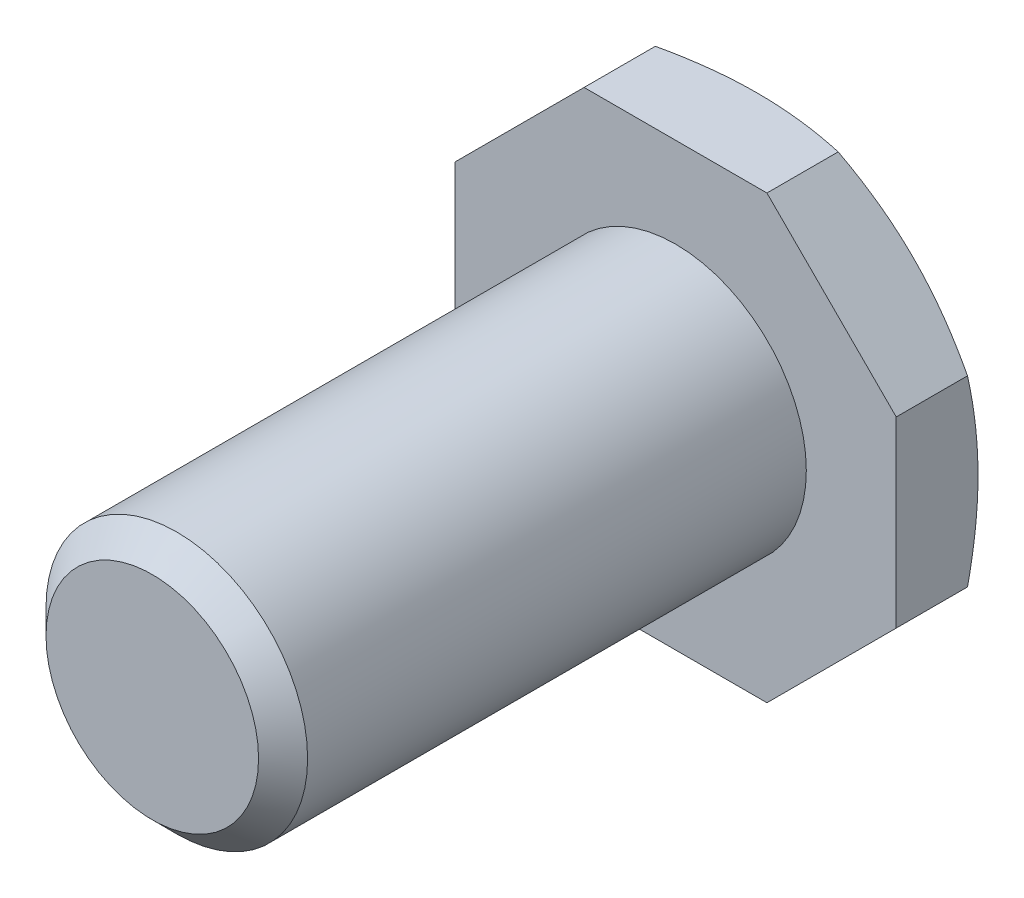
ISO-10303-21;
HEADER;
FILE_DESCRIPTION(('STEP AP214'),'2;1');
FILE_NAME('part.step','',(''),(''),'','','');
FILE_SCHEMA(('AUTOMOTIVE_DESIGN { 1 0 10303 214 1 1 1 1 }'));
ENDSEC;
DATA;
#1=APPLICATION_CONTEXT('core data for automotive mechanical design processes');
#2=APPLICATION_PROTOCOL_DEFINITION('international standard','automotive_design',2000,#1);
#3=PRODUCT_CONTEXT('',#1,'mechanical');
#4=PRODUCT('Part','Part','',(#3));
#5=PRODUCT_RELATED_PRODUCT_CATEGORY('part','',(#4));
#6=PRODUCT_DEFINITION_FORMATION('','',#4);
#7=PRODUCT_DEFINITION_CONTEXT('part definition',#1,'design');
#8=PRODUCT_DEFINITION('design','',#6,#7);
#9=PRODUCT_DEFINITION_SHAPE('','',#8);
#10=(LENGTH_UNIT() NAMED_UNIT(*) SI_UNIT(.MILLI.,.METRE.));
#11=(NAMED_UNIT(*) PLANE_ANGLE_UNIT() SI_UNIT($,.RADIAN.));
#12=(NAMED_UNIT(*) SI_UNIT($,.STERADIAN.) SOLID_ANGLE_UNIT());
#13=UNCERTAINTY_MEASURE_WITH_UNIT(LENGTH_MEASURE(1.E-05),#10,'distance_accuracy_value','');
#14=(GEOMETRIC_REPRESENTATION_CONTEXT(3) GLOBAL_UNCERTAINTY_ASSIGNED_CONTEXT((#13)) GLOBAL_UNIT_ASSIGNED_CONTEXT((#10,
#11,#12)) REPRESENTATION_CONTEXT('',''));
#15=CARTESIAN_POINT('',(0.,0.,0.));
#16=DIRECTION('',(0.,0.,1.));
#17=DIRECTION('',(1.,0.,0.));
#18=AXIS2_PLACEMENT_3D('',#15,#16,#17);
#19=CARTESIAN_POINT('',(0.,0.,22.8865));
#20=DIRECTION('',(0.,0.,1.));
#21=DIRECTION('',(0.,1.,0.));
#22=AXIS2_PLACEMENT_3D('',#19,#20,#21);
#23=CYLINDRICAL_SURFACE('',#22,8.);
#24=CARTESIAN_POINT('',(0.,0.,35.5));
#25=DIRECTION('',(0.,0.,1.));
#26=DIRECTION('',(1.,0.,0.));
#27=AXIS2_PLACEMENT_3D('',#24,#25,#26);
#28=CIRCLE('',#27,8.);
#29=CARTESIAN_POINT('',(8.,0.,35.5));
#30=VERTEX_POINT('',#29);
#31=EDGE_CURVE('E9',#30,#30,#28,.F.);
#32=ORIENTED_EDGE('',*,*,#31,.T.);
#33=EDGE_LOOP('',(#32));
#34=FACE_BOUND('',#33,.T.);
#35=CARTESIAN_POINT('',(0.,0.,5.));
#36=DIRECTION('',(0.,0.,1.));
#37=DIRECTION('',(0.,1.,0.));
#38=AXIS2_PLACEMENT_3D('',#35,#36,#37);
#39=CIRCLE('',#38,8.);
#40=CARTESIAN_POINT('',(0.,8.,5.));
#41=VERTEX_POINT('',#40);
#42=EDGE_CURVE('E201',#41,#41,#39,.T.);
#43=ORIENTED_EDGE('',*,*,#42,.T.);
#44=EDGE_LOOP('',(#43));
#45=FACE_BOUND('',#44,.T.);
#46=ADVANCED_FACE('F14',(#34,#45),#23,.T.);
#47=CARTESIAN_POINT('',(0.,-6.75,0.));
#48=DIRECTION('',(0.,0.,-1.));
#49=DIRECTION('',(0.,-1.,0.));
#50=AXIS2_PLACEMENT_3D('',#47,#48,#49);
#51=PLANE('',#50);
#52=CARTESIAN_POINT('',(0.,0.,0.));
#53=DIRECTION('',(0.,0.,1.));
#54=DIRECTION('',(0.,1.,0.));
#55=AXIS2_PLACEMENT_3D('',#52,#53,#54);
#56=CIRCLE('',#55,13.5);
#57=CARTESIAN_POINT('',(9.54594154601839,-9.54594154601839,0.));
#58=VERTEX_POINT('',#57);
#59=CARTESIAN_POINT('',(13.5,0.,0.));
#60=VERTEX_POINT('',#59);
#61=EDGE_CURVE('E101',#58,#60,#56,.T.);
#62=ORIENTED_EDGE('',*,*,#61,.F.);
#63=CARTESIAN_POINT('',(0.,0.,0.));
#64=DIRECTION('',(0.,0.,1.));
#65=DIRECTION('',(0.,1.,0.));
#66=AXIS2_PLACEMENT_3D('',#63,#64,#65);
#67=CIRCLE('',#66,13.5);
#68=CARTESIAN_POINT('',(0.,-13.5,0.));
#69=VERTEX_POINT('',#68);
#70=EDGE_CURVE('E98',#69,#58,#67,.T.);
#71=ORIENTED_EDGE('',*,*,#70,.F.);
#72=CARTESIAN_POINT('',(0.,0.,0.));
#73=DIRECTION('',(0.,0.,1.));
#74=DIRECTION('',(0.,1.,0.));
#75=AXIS2_PLACEMENT_3D('',#72,#73,#74);
#76=CIRCLE('',#75,13.5);
#77=CARTESIAN_POINT('',(-9.54594154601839,-9.54594154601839,0.));
#78=VERTEX_POINT('',#77);
#79=EDGE_CURVE('E404',#78,#69,#76,.T.);
#80=ORIENTED_EDGE('',*,*,#79,.F.);
#81=CARTESIAN_POINT('',(0.,0.,0.));
#82=DIRECTION('',(0.,0.,1.));
#83=DIRECTION('',(0.,1.,0.));
#84=AXIS2_PLACEMENT_3D('',#81,#82,#83);
#85=CIRCLE('',#84,13.5);
#86=CARTESIAN_POINT('',(-13.5,0.,0.));
#87=VERTEX_POINT('',#86);
#88=EDGE_CURVE('E164',#87,#78,#85,.T.);
#89=ORIENTED_EDGE('',*,*,#88,.F.);
#90=CARTESIAN_POINT('',(0.,0.,0.));
#91=DIRECTION('',(0.,0.,1.));
#92=DIRECTION('',(0.,1.,0.));
#93=AXIS2_PLACEMENT_3D('',#90,#91,#92);
#94=CIRCLE('',#93,13.5);
#95=CARTESIAN_POINT('',(-9.54594154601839,9.54594154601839,0.));
#96=VERTEX_POINT('',#95);
#97=EDGE_CURVE('E424',#96,#87,#94,.T.);
#98=ORIENTED_EDGE('',*,*,#97,.F.);
#99=CARTESIAN_POINT('',(0.,0.,0.));
#100=DIRECTION('',(0.,0.,1.));
#101=DIRECTION('',(0.,1.,0.));
#102=AXIS2_PLACEMENT_3D('',#99,#100,#101);
#103=CIRCLE('',#102,13.5);
#104=CARTESIAN_POINT('',(0.,13.5,0.));
#105=VERTEX_POINT('',#104);
#106=EDGE_CURVE('E425',#105,#96,#103,.T.);
#107=ORIENTED_EDGE('',*,*,#106,.F.);
#108=CARTESIAN_POINT('',(0.,0.,0.));
#109=DIRECTION('',(0.,0.,1.));
#110=DIRECTION('',(0.,1.,0.));
#111=AXIS2_PLACEMENT_3D('',#108,#109,#110);
#112=CIRCLE('',#111,13.5);
#113=CARTESIAN_POINT('',(9.54594154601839,9.54594154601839,0.));
#114=VERTEX_POINT('',#113);
#115=EDGE_CURVE('E427',#114,#105,#112,.T.);
#116=ORIENTED_EDGE('',*,*,#115,.F.);
#117=CARTESIAN_POINT('',(0.,0.,0.));
#118=DIRECTION('',(0.,0.,1.));
#119=DIRECTION('',(0.,1.,0.));
#120=AXIS2_PLACEMENT_3D('',#117,#118,#119);
#121=CIRCLE('',#120,13.5);
#122=EDGE_CURVE('E104',#60,#114,#121,.T.);
#123=ORIENTED_EDGE('',*,*,#122,.F.);
#124=EDGE_LOOP('',(#62,#71,#80,#89,#98,#107,#116,#123));
#125=FACE_BOUND('',#124,.T.);
#126=ADVANCED_FACE('F102',(#125),#51,.T.);
#127=CARTESIAN_POINT('',(0.,0.,0.646036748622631));
#128=DIRECTION('',(0.,0.,1.));
#129=DIRECTION('',(0.,1.,0.));
#130=AXIS2_PLACEMENT_3D('',#127,#128,#129);
#131=CONICAL_SURFACE('',#130,14.618968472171,1.0471975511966);
#132=CARTESIAN_POINT('',(5.59188309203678,-13.5,0.642183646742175));
#133=CARTESIAN_POINT('',(5.36212723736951,-13.5,0.591421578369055));
#134=CARTESIAN_POINT('',(5.13181713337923,-13.5,0.543207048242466));
#135=CARTESIAN_POINT('',(4.67009972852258,-13.5,0.452239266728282));
#136=CARTESIAN_POINT('',(4.43869232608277,-13.5,0.409486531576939));
#137=CARTESIAN_POINT('',(3.74435537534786,-13.5,0.290233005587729));
#138=CARTESIAN_POINT('',(3.27987510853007,-13.5,0.222415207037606));
#139=CARTESIAN_POINT('',(2.58083893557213,-13.5,0.140054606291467));
#140=CARTESIAN_POINT('',(2.34738626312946,-13.5,0.115825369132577));
#141=CARTESIAN_POINT('',(1.87987316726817,-13.5,0.0740751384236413));
#142=CARTESIAN_POINT('',(1.64581274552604,-13.5,0.0565541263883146));
#143=CARTESIAN_POINT('',(1.17657417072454,-13.5,0.028382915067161));
#144=CARTESIAN_POINT('',(0.941394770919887,-13.5,0.0177534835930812));
#145=CARTESIAN_POINT('',(0.470811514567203,-13.5,0.00355463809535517));
#146=CARTESIAN_POINT('',(0.23540764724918,-13.5,-1.44181495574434E-05));
#147=CARTESIAN_POINT('',(0.,-13.5,0.));
#148=B_SPLINE_CURVE_WITH_KNOTS('',3,(#132,#133,#134,#135,#136,#137,#138,#139,#140,#141,#142,
#143,#144,#145,#146,#147),.UNSPECIFIED.,.F.,.F.,(4,2,2,2,2,2,2,4),(0.,0.705854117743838,
1.41177490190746,2.8192062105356,3.52324995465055,4.22729175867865,4.93344545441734,
5.63963493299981),.UNSPECIFIED.);
#149=CARTESIAN_POINT('',(5.59188309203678,-13.5,0.642183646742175));
#150=VERTEX_POINT('',#149);
#151=EDGE_CURVE('E114',#150,#69,#148,.T.);
#152=ORIENTED_EDGE('',*,*,#151,.T.);
#153=ORIENTED_EDGE('',*,*,#70,.T.);
#154=CARTESIAN_POINT('',(9.54594154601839,-9.54594154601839,0.));
#155=CARTESIAN_POINT('',(9.37948320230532,-9.71239988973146,-1.44181495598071E-05));
#156=CARTESIAN_POINT('',(9.2130275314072,-9.87885556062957,0.00355463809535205));
#157=CARTESIAN_POINT('',(8.88027491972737,-10.2116081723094,0.0177534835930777));
#158=CARTESIAN_POINT('',(8.71397797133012,-10.3779051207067,0.0283829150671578));
#159=CARTESIAN_POINT('',(8.38217619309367,-10.7097068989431,0.056554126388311));
#160=CARTESIAN_POINT('',(8.21667048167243,-10.8752126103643,0.0740751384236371));
#161=CARTESIAN_POINT('',(7.88608880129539,-11.2057942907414,0.115825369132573));
#162=CARTESIAN_POINT('',(7.72101283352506,-11.3708702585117,0.140054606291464));
#163=CARTESIAN_POINT('',(7.22671961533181,-11.865163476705,0.222415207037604));
#164=CARTESIAN_POINT('',(6.89828246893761,-12.1936006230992,0.290233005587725));
#165=CARTESIAN_POINT('',(6.40731210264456,-12.6845709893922,0.409486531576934));
#166=CARTESIAN_POINT('',(6.2436823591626,-12.8482007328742,0.452239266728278));
#167=CARTESIAN_POINT('',(5.91719885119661,-13.1746842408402,0.543207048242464));
#168=CARTESIAN_POINT('',(5.75434501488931,-13.3375380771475,0.591421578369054));
#169=CARTESIAN_POINT('',(5.59188309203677,-13.5,0.642183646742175));
#170=B_SPLINE_CURVE_WITH_KNOTS('',3,(#154,#155,#156,#157,#158,#159,#160,#161,#162,#163,#164,
#165,#166,#167,#168,#169),.UNSPECIFIED.,.F.,.F.,(4,2,2,2,2,2,2,4),(0.,0.706189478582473,
1.41234317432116,2.11638497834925,2.8204287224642,4.22786003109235,4.93378081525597,
5.63963493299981),.UNSPECIFIED.);
#171=EDGE_CURVE('E112',#58,#150,#170,.T.);
#172=ORIENTED_EDGE('',*,*,#171,.T.);
#173=EDGE_LOOP('',(#152,#153,#172));
#174=FACE_BOUND('',#173,.T.);
#175=ADVANCED_FACE('F110',(#174),#131,.T.);
#176=CARTESIAN_POINT('',(0.,0.,0.646036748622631));
#177=DIRECTION('',(0.,0.,1.));
#178=DIRECTION('',(0.,1.,0.));
#179=AXIS2_PLACEMENT_3D('',#176,#177,#178);
#180=CONICAL_SURFACE('',#179,14.618968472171,1.0471975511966);
#181=CARTESIAN_POINT('',(13.5,-5.59188309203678,0.642183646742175));
#182=CARTESIAN_POINT('',(13.3375380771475,-5.75434501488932,0.591421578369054));
#183=CARTESIAN_POINT('',(13.1746842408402,-5.91719885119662,0.543207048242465));
#184=CARTESIAN_POINT('',(12.8482007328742,-6.24368235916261,0.452239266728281));
#185=CARTESIAN_POINT('',(12.6845709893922,-6.40731210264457,0.409486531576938));
#186=CARTESIAN_POINT('',(12.1936006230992,-6.89828246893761,0.290233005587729));
#187=CARTESIAN_POINT('',(11.865163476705,-7.22671961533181,0.222415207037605));
#188=CARTESIAN_POINT('',(11.3708702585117,-7.72101283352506,0.140054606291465));
#189=CARTESIAN_POINT('',(11.2057942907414,-7.88608880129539,0.115825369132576));
#190=CARTESIAN_POINT('',(10.8752126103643,-8.21667048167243,0.0740751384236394));
#191=CARTESIAN_POINT('',(10.7097068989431,-8.38217619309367,0.0565541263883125));
#192=CARTESIAN_POINT('',(10.3779051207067,-8.71397797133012,0.0283829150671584));
#193=CARTESIAN_POINT('',(10.2116081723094,-8.88027491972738,0.0177534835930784));
#194=CARTESIAN_POINT('',(9.87885556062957,-9.2130275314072,0.00355463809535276));
#195=CARTESIAN_POINT('',(9.71239988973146,-9.37948320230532,-1.44181495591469E-05));
#196=CARTESIAN_POINT('',(9.54594154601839,-9.54594154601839,0.));
#197=B_SPLINE_CURVE_WITH_KNOTS('',3,(#181,#182,#183,#184,#185,#186,#187,#188,#189,#190,#191,
#192,#193,#194,#195,#196),.UNSPECIFIED.,.F.,.F.,(4,2,2,2,2,2,2,4),(0.,0.705854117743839,
1.41177490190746,2.8192062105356,3.52324995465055,4.22729175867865,4.93344545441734,
5.63963493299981),.UNSPECIFIED.);
#198=CARTESIAN_POINT('',(13.5,-5.59188309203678,0.642183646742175));
#199=VERTEX_POINT('',#198);
#200=EDGE_CURVE('E118',#199,#58,#197,.T.);
#201=ORIENTED_EDGE('',*,*,#200,.T.);
#202=ORIENTED_EDGE('',*,*,#61,.T.);
#203=CARTESIAN_POINT('',(13.5,0.,0.));
#204=CARTESIAN_POINT('',(13.5,-0.235407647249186,-1.44181495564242E-05));
#205=CARTESIAN_POINT('',(13.5,-0.470811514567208,0.00355463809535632));
#206=CARTESIAN_POINT('',(13.5,-0.941394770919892,0.017753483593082));
#207=CARTESIAN_POINT('',(13.5,-1.17657417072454,0.0283829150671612));
#208=CARTESIAN_POINT('',(13.5,-1.64581274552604,0.0565541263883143));
#209=CARTESIAN_POINT('',(13.5,-1.87987316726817,0.074075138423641));
#210=CARTESIAN_POINT('',(13.5,-2.34738626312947,0.115825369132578));
#211=CARTESIAN_POINT('',(13.5,-2.58083893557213,0.140054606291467));
#212=CARTESIAN_POINT('',(13.5,-3.27987510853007,0.222415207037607));
#213=CARTESIAN_POINT('',(13.5,-3.74435537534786,0.290233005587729));
#214=CARTESIAN_POINT('',(13.5,-4.43869232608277,0.409486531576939));
#215=CARTESIAN_POINT('',(13.5,-4.67009972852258,0.452239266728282));
#216=CARTESIAN_POINT('',(13.5,-5.13181713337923,0.543207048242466));
#217=CARTESIAN_POINT('',(13.5,-5.36212723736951,0.591421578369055));
#218=CARTESIAN_POINT('',(13.5,-5.59188309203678,0.642183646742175));
#219=B_SPLINE_CURVE_WITH_KNOTS('',3,(#203,#204,#205,#206,#207,#208,#209,#210,#211,#212,#213,
#214,#215,#216,#217,#218),.UNSPECIFIED.,.F.,.F.,(4,2,2,2,2,2,2,4),(0.,0.70618947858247,
1.41234317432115,2.11638497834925,2.8204287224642,4.22786003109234,4.93378081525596,
5.6396349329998),.UNSPECIFIED.);
#220=EDGE_CURVE('E121',#60,#199,#219,.T.);
#221=ORIENTED_EDGE('',*,*,#220,.T.);
#222=EDGE_LOOP('',(#201,#202,#221));
#223=FACE_BOUND('',#222,.T.);
#224=ADVANCED_FACE('F119',(#223),#180,.T.);
#225=CARTESIAN_POINT('',(0.,0.,0.646036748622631));
#226=DIRECTION('',(0.,0.,1.));
#227=DIRECTION('',(0.,1.,0.));
#228=AXIS2_PLACEMENT_3D('',#225,#226,#227);
#229=CONICAL_SURFACE('',#228,14.618968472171,1.0471975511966);
#230=CARTESIAN_POINT('',(13.5,5.59188309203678,0.642183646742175));
#231=CARTESIAN_POINT('',(13.5,5.36212723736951,0.591421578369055));
#232=CARTESIAN_POINT('',(13.5,5.13181713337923,0.543207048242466));
#233=CARTESIAN_POINT('',(13.5,4.67009972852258,0.452239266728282));
#234=CARTESIAN_POINT('',(13.5,4.43869232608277,0.409486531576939));
#235=CARTESIAN_POINT('',(13.5,3.74435537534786,0.290233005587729));
#236=CARTESIAN_POINT('',(13.5,3.27987510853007,0.222415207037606));
#237=CARTESIAN_POINT('',(13.5,2.58083893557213,0.140054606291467));
#238=CARTESIAN_POINT('',(13.5,2.34738626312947,0.115825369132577));
#239=CARTESIAN_POINT('',(13.5,1.87987316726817,0.0740751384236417));
#240=CARTESIAN_POINT('',(13.5,1.64581274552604,0.0565541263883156));
#241=CARTESIAN_POINT('',(13.5,1.17657417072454,0.028382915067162));
#242=CARTESIAN_POINT('',(13.5,0.941394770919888,0.0177534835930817));
#243=CARTESIAN_POINT('',(13.5,0.470811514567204,0.00355463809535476));
#244=CARTESIAN_POINT('',(13.5,0.235407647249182,-1.44181495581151E-05));
#245=CARTESIAN_POINT('',(13.5,0.,0.));
#246=B_SPLINE_CURVE_WITH_KNOTS('',3,(#230,#231,#232,#233,#234,#235,#236,#237,#238,#239,#240,
#241,#242,#243,#244,#245),.UNSPECIFIED.,.F.,.F.,(4,2,2,2,2,2,2,4),(0.,0.705854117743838,
1.41177490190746,2.8192062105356,3.52324995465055,4.22729175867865,4.93344545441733,
5.6396349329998),.UNSPECIFIED.);
#247=CARTESIAN_POINT('',(13.5,5.59188309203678,0.642183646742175));
#248=VERTEX_POINT('',#247);
#249=EDGE_CURVE('E292',#248,#60,#246,.T.);
#250=ORIENTED_EDGE('',*,*,#249,.T.);
#251=ORIENTED_EDGE('',*,*,#122,.T.);
#252=CARTESIAN_POINT('',(9.54594154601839,9.54594154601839,0.));
#253=CARTESIAN_POINT('',(9.71239988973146,9.37948320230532,-1.44181495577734E-05));
#254=CARTESIAN_POINT('',(9.87885556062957,9.21302753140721,0.00355463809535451));
#255=CARTESIAN_POINT('',(10.2116081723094,8.88027491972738,0.0177534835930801));
#256=CARTESIAN_POINT('',(10.3779051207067,8.71397797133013,0.0283829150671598));
#257=CARTESIAN_POINT('',(10.7097068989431,8.38217619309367,0.0565541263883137));
#258=CARTESIAN_POINT('',(10.8752126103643,8.21667048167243,0.0740751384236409));
#259=CARTESIAN_POINT('',(11.2057942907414,7.88608880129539,0.115825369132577));
#260=CARTESIAN_POINT('',(11.3708702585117,7.72101283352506,0.140054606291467));
#261=CARTESIAN_POINT('',(11.865163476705,7.22671961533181,0.222415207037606));
#262=CARTESIAN_POINT('',(12.1936006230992,6.89828246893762,0.290233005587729));
#263=CARTESIAN_POINT('',(12.6845709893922,6.40731210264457,0.409486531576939));
#264=CARTESIAN_POINT('',(12.8482007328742,6.24368235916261,0.452239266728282));
#265=CARTESIAN_POINT('',(13.1746842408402,5.91719885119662,0.543207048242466));
#266=CARTESIAN_POINT('',(13.3375380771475,5.75434501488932,0.591421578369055));
#267=CARTESIAN_POINT('',(13.5,5.59188309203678,0.642183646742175));
#268=B_SPLINE_CURVE_WITH_KNOTS('',3,(#252,#253,#254,#255,#256,#257,#258,#259,#260,#261,#262,
#263,#264,#265,#266,#267),.UNSPECIFIED.,.F.,.F.,(4,2,2,2,2,2,2,4),(0.,0.70618947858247,
1.41234317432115,2.11638497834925,2.8204287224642,4.22786003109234,4.93378081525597,
5.63963493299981),.UNSPECIFIED.);
#269=EDGE_CURVE('E285',#114,#248,#268,.T.);
#270=ORIENTED_EDGE('',*,*,#269,.T.);
#271=EDGE_LOOP('',(#250,#251,#270));
#272=FACE_BOUND('',#271,.T.);
#273=ADVANCED_FACE('F297',(#272),#229,.T.);
#274=CARTESIAN_POINT('',(0.,0.,0.646036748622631));
#275=DIRECTION('',(0.,0.,1.));
#276=DIRECTION('',(0.,1.,0.));
#277=AXIS2_PLACEMENT_3D('',#274,#275,#276);
#278=CONICAL_SURFACE('',#277,14.618968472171,1.0471975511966);
#279=CARTESIAN_POINT('',(5.59188309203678,13.5,0.642183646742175));
#280=CARTESIAN_POINT('',(5.75434501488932,13.3375380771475,0.591421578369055));
#281=CARTESIAN_POINT('',(5.91719885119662,13.1746842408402,0.543207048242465));
#282=CARTESIAN_POINT('',(6.24368235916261,12.8482007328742,0.452239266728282));
#283=CARTESIAN_POINT('',(6.40731210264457,12.6845709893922,0.409486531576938));
#284=CARTESIAN_POINT('',(6.89828246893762,12.1936006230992,0.29023300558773));
#285=CARTESIAN_POINT('',(7.22671961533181,11.865163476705,0.222415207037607));
#286=CARTESIAN_POINT('',(7.72101283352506,11.3708702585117,0.140054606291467));
#287=CARTESIAN_POINT('',(7.88608880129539,11.2057942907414,0.115825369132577));
#288=CARTESIAN_POINT('',(8.21667048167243,10.8752126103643,0.0740751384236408));
#289=CARTESIAN_POINT('',(8.38217619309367,10.7097068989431,0.0565541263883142));
#290=CARTESIAN_POINT('',(8.71397797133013,10.3779051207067,0.0283829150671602));
#291=CARTESIAN_POINT('',(8.88027491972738,10.2116081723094,0.01775348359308));
#292=CARTESIAN_POINT('',(9.21302753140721,9.87885556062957,0.00355463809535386));
#293=CARTESIAN_POINT('',(9.37948320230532,9.71239988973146,-1.44181495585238E-05));
#294=CARTESIAN_POINT('',(9.54594154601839,9.54594154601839,0.));
#295=B_SPLINE_CURVE_WITH_KNOTS('',3,(#279,#280,#281,#282,#283,#284,#285,#286,#287,#288,#289,
#290,#291,#292,#293,#294),.UNSPECIFIED.,.F.,.F.,(4,2,2,2,2,2,2,4),(0.,0.705854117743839,
1.41177490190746,2.81920621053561,3.52324995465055,4.22729175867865,4.93344545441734,
5.63963493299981),.UNSPECIFIED.);
#296=CARTESIAN_POINT('',(5.59188309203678,13.5,0.642183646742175));
#297=VERTEX_POINT('',#296);
#298=EDGE_CURVE('E279',#297,#114,#295,.T.);
#299=ORIENTED_EDGE('',*,*,#298,.T.);
#300=ORIENTED_EDGE('',*,*,#115,.T.);
#301=CARTESIAN_POINT('',(0.,13.5,0.));
#302=CARTESIAN_POINT('',(0.235407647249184,13.5,-1.44181495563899E-05));
#303=CARTESIAN_POINT('',(0.470811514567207,13.5,0.00355463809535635));
#304=CARTESIAN_POINT('',(0.941394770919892,13.5,0.017753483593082));
#305=CARTESIAN_POINT('',(1.17657417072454,13.5,0.0283829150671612));
#306=CARTESIAN_POINT('',(1.64581274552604,13.5,0.0565541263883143));
#307=CARTESIAN_POINT('',(1.87987316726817,13.5,0.074075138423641));
#308=CARTESIAN_POINT('',(2.34738626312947,13.5,0.115825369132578));
#309=CARTESIAN_POINT('',(2.58083893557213,13.5,0.140054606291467));
#310=CARTESIAN_POINT('',(3.27987510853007,13.5,0.222415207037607));
#311=CARTESIAN_POINT('',(3.74435537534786,13.5,0.290233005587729));
#312=CARTESIAN_POINT('',(4.43869232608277,13.5,0.409486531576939));
#313=CARTESIAN_POINT('',(4.67009972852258,13.5,0.452239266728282));
#314=CARTESIAN_POINT('',(5.13181713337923,13.5,0.543207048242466));
#315=CARTESIAN_POINT('',(5.36212723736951,13.5,0.591421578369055));
#316=CARTESIAN_POINT('',(5.59188309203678,13.5,0.642183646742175));
#317=B_SPLINE_CURVE_WITH_KNOTS('',3,(#301,#302,#303,#304,#305,#306,#307,#308,#309,#310,#311,
#312,#313,#314,#315,#316),.UNSPECIFIED.,.F.,.F.,(4,2,2,2,2,2,2,4),(0.,0.706189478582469,
1.41234317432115,2.11638497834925,2.8204287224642,4.22786003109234,4.93378081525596,
5.6396349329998),.UNSPECIFIED.);
#318=EDGE_CURVE('E260',#105,#297,#317,.T.);
#319=ORIENTED_EDGE('',*,*,#318,.T.);
#320=EDGE_LOOP('',(#299,#300,#319));
#321=FACE_BOUND('',#320,.T.);
#322=ADVANCED_FACE('F300',(#321),#278,.T.);
#323=CARTESIAN_POINT('',(0.,0.,0.646036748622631));
#324=DIRECTION('',(0.,0.,1.));
#325=DIRECTION('',(0.,1.,0.));
#326=AXIS2_PLACEMENT_3D('',#323,#324,#325);
#327=CONICAL_SURFACE('',#326,14.618968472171,1.0471975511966);
#328=ORIENTED_EDGE('',*,*,#106,.T.);
#329=CARTESIAN_POINT('',(-9.54594154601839,9.54594154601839,0.));
#330=CARTESIAN_POINT('',(-9.37948320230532,9.71239988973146,-1.44181495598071E-05));
#331=CARTESIAN_POINT('',(-9.2130275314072,9.87885556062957,0.00355463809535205));
#332=CARTESIAN_POINT('',(-8.88027491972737,10.2116081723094,0.0177534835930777));
#333=CARTESIAN_POINT('',(-8.71397797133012,10.3779051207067,0.0283829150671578));
#334=CARTESIAN_POINT('',(-8.38217619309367,10.7097068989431,0.056554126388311));
#335=CARTESIAN_POINT('',(-8.21667048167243,10.8752126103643,0.0740751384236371));
#336=CARTESIAN_POINT('',(-7.88608880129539,11.2057942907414,0.115825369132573));
#337=CARTESIAN_POINT('',(-7.72101283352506,11.3708702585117,0.140054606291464));
#338=CARTESIAN_POINT('',(-7.22671961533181,11.865163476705,0.222415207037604));
#339=CARTESIAN_POINT('',(-6.89828246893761,12.1936006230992,0.290233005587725));
#340=CARTESIAN_POINT('',(-6.40731210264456,12.6845709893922,0.409486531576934));
#341=CARTESIAN_POINT('',(-6.2436823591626,12.8482007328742,0.452239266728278));
#342=CARTESIAN_POINT('',(-5.91719885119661,13.1746842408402,0.543207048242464));
#343=CARTESIAN_POINT('',(-5.75434501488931,13.3375380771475,0.591421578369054));
#344=CARTESIAN_POINT('',(-5.59188309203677,13.5,0.642183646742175));
#345=B_SPLINE_CURVE_WITH_KNOTS('',3,(#329,#330,#331,#332,#333,#334,#335,#336,#337,#338,#339,
#340,#341,#342,#343,#344),.UNSPECIFIED.,.F.,.F.,(4,2,2,2,2,2,2,4),(0.,0.706189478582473,
1.41234317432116,2.11638497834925,2.8204287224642,4.22786003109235,4.93378081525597,
5.63963493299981),.UNSPECIFIED.);
#346=CARTESIAN_POINT('',(-5.59188309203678,13.5,0.642183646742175));
#347=VERTEX_POINT('',#346);
#348=EDGE_CURVE('E246',#96,#347,#345,.T.);
#349=ORIENTED_EDGE('',*,*,#348,.T.);
#350=CARTESIAN_POINT('',(-5.59188309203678,13.5,0.642183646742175));
#351=CARTESIAN_POINT('',(-5.36212723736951,13.5,0.591421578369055));
#352=CARTESIAN_POINT('',(-5.13181713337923,13.5,0.543207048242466));
#353=CARTESIAN_POINT('',(-4.67009972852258,13.5,0.452239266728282));
#354=CARTESIAN_POINT('',(-4.43869232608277,13.5,0.409486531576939));
#355=CARTESIAN_POINT('',(-3.74435537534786,13.5,0.290233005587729));
#356=CARTESIAN_POINT('',(-3.27987510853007,13.5,0.222415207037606));
#357=CARTESIAN_POINT('',(-2.58083893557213,13.5,0.140054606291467));
#358=CARTESIAN_POINT('',(-2.34738626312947,13.5,0.115825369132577));
#359=CARTESIAN_POINT('',(-1.87987316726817,13.5,0.0740751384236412));
#360=CARTESIAN_POINT('',(-1.64581274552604,13.5,0.0565541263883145));
#361=CARTESIAN_POINT('',(-1.17657417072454,13.5,0.028382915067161));
#362=CARTESIAN_POINT('',(-0.941394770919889,13.5,0.0177534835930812));
#363=CARTESIAN_POINT('',(-0.470811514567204,13.5,0.00355463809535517));
#364=CARTESIAN_POINT('',(-0.235407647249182,13.5,-1.44181495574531E-05));
#365=CARTESIAN_POINT('',(0.,13.5,0.));
#366=B_SPLINE_CURVE_WITH_KNOTS('',3,(#350,#351,#352,#353,#354,#355,#356,#357,#358,#359,#360,
#361,#362,#363,#364,#365),.UNSPECIFIED.,.F.,.F.,(4,2,2,2,2,2,2,4),(0.,0.705854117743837,
1.41177490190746,2.8192062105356,3.52324995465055,4.22729175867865,4.93344545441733,
5.6396349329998),.UNSPECIFIED.);
#367=EDGE_CURVE('E252',#347,#105,#366,.T.);
#368=ORIENTED_EDGE('',*,*,#367,.T.);
#369=EDGE_LOOP('',(#328,#349,#368));
#370=FACE_BOUND('',#369,.T.);
#371=ADVANCED_FACE('F233',(#370),#327,.T.);
#372=CARTESIAN_POINT('',(0.,0.,0.646036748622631));
#373=DIRECTION('',(0.,0.,1.));
#374=DIRECTION('',(0.,1.,0.));
#375=AXIS2_PLACEMENT_3D('',#372,#373,#374);
#376=CONICAL_SURFACE('',#375,14.618968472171,1.0471975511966);
#377=ORIENTED_EDGE('',*,*,#97,.T.);
#378=CARTESIAN_POINT('',(-13.5,0.,0.));
#379=CARTESIAN_POINT('',(-13.5,0.235407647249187,-1.44181495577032E-05));
#380=CARTESIAN_POINT('',(-13.5,0.470811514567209,0.00355463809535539));
#381=CARTESIAN_POINT('',(-13.5,0.941394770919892,0.0177534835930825));
#382=CARTESIAN_POINT('',(-13.5,1.17657417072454,0.0283829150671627));
#383=CARTESIAN_POINT('',(-13.5,1.64581274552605,0.0565541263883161));
#384=CARTESIAN_POINT('',(-13.5,1.87987316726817,0.074075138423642));
#385=CARTESIAN_POINT('',(-13.5,2.34738626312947,0.115825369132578));
#386=CARTESIAN_POINT('',(-13.5,2.58083893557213,0.140054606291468));
#387=CARTESIAN_POINT('',(-13.5,3.27987510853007,0.222415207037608));
#388=CARTESIAN_POINT('',(-13.5,3.74435537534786,0.29023300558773));
#389=CARTESIAN_POINT('',(-13.5,4.43869232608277,0.409486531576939));
#390=CARTESIAN_POINT('',(-13.5,4.67009972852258,0.452239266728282));
#391=CARTESIAN_POINT('',(-13.5,5.13181713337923,0.543207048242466));
#392=CARTESIAN_POINT('',(-13.5,5.36212723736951,0.591421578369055));
#393=CARTESIAN_POINT('',(-13.5,5.59188309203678,0.642183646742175));
#394=B_SPLINE_CURVE_WITH_KNOTS('',3,(#378,#379,#380,#381,#382,#383,#384,#385,#386,#387,#388,
#389,#390,#391,#392,#393),.UNSPECIFIED.,.F.,.F.,(4,2,2,2,2,2,2,4),(0.,0.706189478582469,
1.41234317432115,2.11638497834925,2.8204287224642,4.22786003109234,4.93378081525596,
5.6396349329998),.UNSPECIFIED.);
#395=CARTESIAN_POINT('',(-13.5,5.59188309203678,0.642183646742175));
#396=VERTEX_POINT('',#395);
#397=EDGE_CURVE('E223',#87,#396,#394,.T.);
#398=ORIENTED_EDGE('',*,*,#397,.T.);
#399=CARTESIAN_POINT('',(-13.5,5.59188309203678,0.642183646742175));
#400=CARTESIAN_POINT('',(-13.3375380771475,5.75434501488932,0.591421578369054));
#401=CARTESIAN_POINT('',(-13.1746842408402,5.91719885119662,0.543207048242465));
#402=CARTESIAN_POINT('',(-12.8482007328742,6.24368235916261,0.452239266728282));
#403=CARTESIAN_POINT('',(-12.6845709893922,6.40731210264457,0.409486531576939));
#404=CARTESIAN_POINT('',(-12.1936006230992,6.89828246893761,0.29023300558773));
#405=CARTESIAN_POINT('',(-11.865163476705,7.22671961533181,0.222415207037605));
#406=CARTESIAN_POINT('',(-11.3708702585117,7.72101283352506,0.140054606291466));
#407=CARTESIAN_POINT('',(-11.2057942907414,7.88608880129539,0.115825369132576));
#408=CARTESIAN_POINT('',(-10.8752126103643,8.21667048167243,0.07407513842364));
#409=CARTESIAN_POINT('',(-10.7097068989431,8.38217619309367,0.0565541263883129));
#410=CARTESIAN_POINT('',(-10.3779051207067,8.71397797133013,0.0283829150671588));
#411=CARTESIAN_POINT('',(-10.2116081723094,8.88027491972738,0.017753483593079));
#412=CARTESIAN_POINT('',(-9.87885556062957,9.21302753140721,0.0035546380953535));
#413=CARTESIAN_POINT('',(-9.71239988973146,9.37948320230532,-1.44181495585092E-05));
#414=CARTESIAN_POINT('',(-9.54594154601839,9.54594154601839,0.));
#415=B_SPLINE_CURVE_WITH_KNOTS('',3,(#399,#400,#401,#402,#403,#404,#405,#406,#407,#408,#409,
#410,#411,#412,#413,#414),.UNSPECIFIED.,.F.,.F.,(4,2,2,2,2,2,2,4),(0.,0.705854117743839,
1.41177490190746,2.8192062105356,3.52324995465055,4.22729175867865,4.93344545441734,
5.63963493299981),.UNSPECIFIED.);
#416=EDGE_CURVE('E239',#396,#96,#415,.T.);
#417=ORIENTED_EDGE('',*,*,#416,.T.);
#418=EDGE_LOOP('',(#377,#398,#417));
#419=FACE_BOUND('',#418,.T.);
#420=ADVANCED_FACE('F229',(#419),#376,.T.);
#421=CARTESIAN_POINT('',(0.,0.,0.646036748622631));
#422=DIRECTION('',(0.,0.,1.));
#423=DIRECTION('',(0.,1.,0.));
#424=AXIS2_PLACEMENT_3D('',#421,#422,#423);
#425=CONICAL_SURFACE('',#424,14.618968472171,1.0471975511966);
#426=ORIENTED_EDGE('',*,*,#79,.T.);
#427=CARTESIAN_POINT('',(0.,-13.5,0.));
#428=CARTESIAN_POINT('',(-0.235407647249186,-13.5,-1.44181495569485E-05));
#429=CARTESIAN_POINT('',(-0.470811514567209,-13.5,0.00355463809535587));
#430=CARTESIAN_POINT('',(-0.941394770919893,-13.5,0.017753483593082));
#431=CARTESIAN_POINT('',(-1.17657417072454,-13.5,0.0283829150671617));
#432=CARTESIAN_POINT('',(-1.64581274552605,-13.5,0.0565541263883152));
#433=CARTESIAN_POINT('',(-1.87987316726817,-13.5,0.0740751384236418));
#434=CARTESIAN_POINT('',(-2.34738626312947,-13.5,0.115825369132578));
#435=CARTESIAN_POINT('',(-2.58083893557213,-13.5,0.140054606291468));
#436=CARTESIAN_POINT('',(-3.27987510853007,-13.5,0.222415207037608));
#437=CARTESIAN_POINT('',(-3.74435537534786,-13.5,0.29023300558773));
#438=CARTESIAN_POINT('',(-4.43869232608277,-13.5,0.409486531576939));
#439=CARTESIAN_POINT('',(-4.67009972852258,-13.5,0.452239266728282));
#440=CARTESIAN_POINT('',(-5.13181713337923,-13.5,0.543207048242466));
#441=CARTESIAN_POINT('',(-5.36212723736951,-13.5,0.591421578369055));
#442=CARTESIAN_POINT('',(-5.59188309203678,-13.5,0.642183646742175));
#443=B_SPLINE_CURVE_WITH_KNOTS('',3,(#427,#428,#429,#430,#431,#432,#433,#434,#435,#436,#437,
#438,#439,#440,#441,#442),.UNSPECIFIED.,.F.,.F.,(4,2,2,2,2,2,2,4),(0.,0.706189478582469,
1.41234317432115,2.11638497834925,2.8204287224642,4.22786003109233,4.93378081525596,
5.6396349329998),.UNSPECIFIED.);
#444=CARTESIAN_POINT('',(-5.59188309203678,-13.5,0.642183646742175));
#445=VERTEX_POINT('',#444);
#446=EDGE_CURVE('E129',#69,#445,#443,.T.);
#447=ORIENTED_EDGE('',*,*,#446,.T.);
#448=CARTESIAN_POINT('',(-5.59188309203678,-13.5,0.642183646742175));
#449=CARTESIAN_POINT('',(-5.75434501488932,-13.3375380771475,0.591421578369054));
#450=CARTESIAN_POINT('',(-5.91719885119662,-13.1746842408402,0.543207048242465));
#451=CARTESIAN_POINT('',(-6.24368235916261,-12.8482007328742,0.452239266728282));
#452=CARTESIAN_POINT('',(-6.40731210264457,-12.6845709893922,0.409486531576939));
#453=CARTESIAN_POINT('',(-6.89828246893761,-12.1936006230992,0.29023300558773));
#454=CARTESIAN_POINT('',(-7.22671961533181,-11.865163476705,0.222415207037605));
#455=CARTESIAN_POINT('',(-7.72101283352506,-11.3708702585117,0.140054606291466));
#456=CARTESIAN_POINT('',(-7.88608880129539,-11.2057942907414,0.115825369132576));
#457=CARTESIAN_POINT('',(-8.21667048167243,-10.8752126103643,0.07407513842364));
#458=CARTESIAN_POINT('',(-8.38217619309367,-10.7097068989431,0.0565541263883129));
#459=CARTESIAN_POINT('',(-8.71397797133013,-10.3779051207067,0.0283829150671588));
#460=CARTESIAN_POINT('',(-8.88027491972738,-10.2116081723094,0.017753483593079));
#461=CARTESIAN_POINT('',(-9.21302753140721,-9.87885556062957,0.0035546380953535));
#462=CARTESIAN_POINT('',(-9.37948320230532,-9.71239988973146,-1.44181495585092E-05));
#463=CARTESIAN_POINT('',(-9.54594154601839,-9.54594154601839,0.));
#464=B_SPLINE_CURVE_WITH_KNOTS('',3,(#448,#449,#450,#451,#452,#453,#454,#455,#456,#457,#458,
#459,#460,#461,#462,#463),.UNSPECIFIED.,.F.,.F.,(4,2,2,2,2,2,2,4),(0.,0.705854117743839,
1.41177490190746,2.8192062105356,3.52324995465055,4.22729175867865,4.93344545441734,
5.63963493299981),.UNSPECIFIED.);
#465=EDGE_CURVE('E200',#445,#78,#464,.T.);
#466=ORIENTED_EDGE('',*,*,#465,.T.);
#467=EDGE_LOOP('',(#426,#447,#466));
#468=FACE_BOUND('',#467,.T.);
#469=ADVANCED_FACE('F175',(#468),#425,.T.);
#470=CARTESIAN_POINT('',(0.,0.,0.646036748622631));
#471=DIRECTION('',(0.,0.,1.));
#472=DIRECTION('',(0.,1.,0.));
#473=AXIS2_PLACEMENT_3D('',#470,#471,#472);
#474=CONICAL_SURFACE('',#473,14.618968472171,1.0471975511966);
#475=ORIENTED_EDGE('',*,*,#88,.T.);
#476=CARTESIAN_POINT('',(-9.54594154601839,-9.54594154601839,0.));
#477=CARTESIAN_POINT('',(-9.71239988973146,-9.37948320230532,-1.44181495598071E-05));
#478=CARTESIAN_POINT('',(-9.87885556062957,-9.2130275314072,0.00355463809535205));
#479=CARTESIAN_POINT('',(-10.2116081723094,-8.88027491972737,0.0177534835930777));
#480=CARTESIAN_POINT('',(-10.3779051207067,-8.71397797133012,0.0283829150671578));
#481=CARTESIAN_POINT('',(-10.7097068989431,-8.38217619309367,0.056554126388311));
#482=CARTESIAN_POINT('',(-10.8752126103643,-8.21667048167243,0.0740751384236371));
#483=CARTESIAN_POINT('',(-11.2057942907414,-7.88608880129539,0.115825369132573));
#484=CARTESIAN_POINT('',(-11.3708702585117,-7.72101283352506,0.140054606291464));
#485=CARTESIAN_POINT('',(-11.865163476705,-7.22671961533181,0.222415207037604));
#486=CARTESIAN_POINT('',(-12.1936006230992,-6.89828246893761,0.290233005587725));
#487=CARTESIAN_POINT('',(-12.6845709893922,-6.40731210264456,0.409486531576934));
#488=CARTESIAN_POINT('',(-12.8482007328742,-6.2436823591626,0.452239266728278));
#489=CARTESIAN_POINT('',(-13.1746842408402,-5.91719885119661,0.543207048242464));
#490=CARTESIAN_POINT('',(-13.3375380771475,-5.75434501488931,0.591421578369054));
#491=CARTESIAN_POINT('',(-13.5,-5.59188309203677,0.642183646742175));
#492=B_SPLINE_CURVE_WITH_KNOTS('',3,(#476,#477,#478,#479,#480,#481,#482,#483,#484,#485,#486,
#487,#488,#489,#490,#491),.UNSPECIFIED.,.F.,.F.,(4,2,2,2,2,2,2,4),(0.,0.706189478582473,
1.41234317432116,2.11638497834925,2.8204287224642,4.22786003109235,4.93378081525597,
5.63963493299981),.UNSPECIFIED.);
#493=CARTESIAN_POINT('',(-13.5,-5.59188309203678,0.642183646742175));
#494=VERTEX_POINT('',#493);
#495=EDGE_CURVE('E190',#78,#494,#492,.T.);
#496=ORIENTED_EDGE('',*,*,#495,.T.);
#497=CARTESIAN_POINT('',(-13.5,-5.59188309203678,0.642183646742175));
#498=CARTESIAN_POINT('',(-13.5,-5.36212723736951,0.591421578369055));
#499=CARTESIAN_POINT('',(-13.5,-5.13181713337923,0.543207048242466));
#500=CARTESIAN_POINT('',(-13.5,-4.67009972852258,0.452239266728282));
#501=CARTESIAN_POINT('',(-13.5,-4.43869232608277,0.409486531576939));
#502=CARTESIAN_POINT('',(-13.5,-3.74435537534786,0.290233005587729));
#503=CARTESIAN_POINT('',(-13.5,-3.27987510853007,0.222415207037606));
#504=CARTESIAN_POINT('',(-13.5,-2.58083893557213,0.140054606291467));
#505=CARTESIAN_POINT('',(-13.5,-2.34738626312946,0.115825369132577));
#506=CARTESIAN_POINT('',(-13.5,-1.87987316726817,0.0740751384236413));
#507=CARTESIAN_POINT('',(-13.5,-1.64581274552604,0.0565541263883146));
#508=CARTESIAN_POINT('',(-13.5,-1.17657417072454,0.028382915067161));
#509=CARTESIAN_POINT('',(-13.5,-0.941394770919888,0.0177534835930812));
#510=CARTESIAN_POINT('',(-13.5,-0.470811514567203,0.00355463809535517));
#511=CARTESIAN_POINT('',(-13.5,-0.23540764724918,-1.44181495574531E-05));
#512=CARTESIAN_POINT('',(-13.5,0.,0.));
#513=B_SPLINE_CURVE_WITH_KNOTS('',3,(#497,#498,#499,#500,#501,#502,#503,#504,#505,#506,#507,
#508,#509,#510,#511,#512),.UNSPECIFIED.,.F.,.F.,(4,2,2,2,2,2,2,4),(0.,0.705854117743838,
1.41177490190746,2.8192062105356,3.52324995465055,4.22729175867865,4.93344545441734,
5.63963493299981),.UNSPECIFIED.);
#514=EDGE_CURVE('E181',#494,#87,#513,.T.);
#515=ORIENTED_EDGE('',*,*,#514,.T.);
#516=EDGE_LOOP('',(#475,#496,#515));
#517=FACE_BOUND('',#516,.T.);
#518=ADVANCED_FACE('F170',(#517),#474,.T.);
#519=CARTESIAN_POINT('',(5.59188309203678,-13.5,5.));
#520=DIRECTION('',(0.,1.,0.));
#521=DIRECTION('',(-1.,0.,0.));
#522=AXIS2_PLACEMENT_3D('',#519,#520,#521);
#523=PLANE('',#522);
#524=ORIENTED_EDGE('',*,*,#151,.F.);
#525=DIRECTION('',(0.,0.,1.));
#526=VECTOR('',#525,1.);
#527=CARTESIAN_POINT('',(5.59188309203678,-13.5,5.));
#528=LINE('',#527,#526);
#529=CARTESIAN_POINT('',(5.59188309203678,-13.5,5.));
#530=VERTEX_POINT('',#529);
#531=EDGE_CURVE('E124',#150,#530,#528,.T.);
#532=ORIENTED_EDGE('',*,*,#531,.T.);
#533=DIRECTION('',(-1.,0.,0.));
#534=VECTOR('',#533,1.);
#535=CARTESIAN_POINT('',(0.,-13.5,5.));
#536=LINE('',#535,#534);
#537=CARTESIAN_POINT('',(-5.59188309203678,-13.5,5.));
#538=VERTEX_POINT('',#537);
#539=EDGE_CURVE('E199',#538,#530,#536,.F.);
#540=ORIENTED_EDGE('',*,*,#539,.F.);
#541=DIRECTION('',(0.,0.,1.));
#542=VECTOR('',#541,1.);
#543=CARTESIAN_POINT('',(-5.59188309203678,-13.5,5.));
#544=LINE('',#543,#542);
#545=EDGE_CURVE('E394',#538,#445,#544,.F.);
#546=ORIENTED_EDGE('',*,*,#545,.T.);
#547=ORIENTED_EDGE('',*,*,#446,.F.);
#548=EDGE_LOOP('',(#524,#532,#540,#546,#547));
#549=FACE_BOUND('',#548,.T.);
#550=ADVANCED_FACE('F166',(#549),#523,.F.);
#551=CARTESIAN_POINT('',(13.5,-5.59188309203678,5.));
#552=DIRECTION('',(-0.707106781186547,0.707106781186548,0.));
#553=DIRECTION('',(-0.707106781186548,-0.707106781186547,0.));
#554=AXIS2_PLACEMENT_3D('',#551,#552,#553);
#555=PLANE('',#554);
#556=DIRECTION('',(0.,0.,1.));
#557=VECTOR('',#556,1.);
#558=CARTESIAN_POINT('',(13.5,-5.59188309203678,5.));
#559=LINE('',#558,#557);
#560=CARTESIAN_POINT('',(13.5,-5.59188309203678,5.));
#561=VERTEX_POINT('',#560);
#562=EDGE_CURVE('E376',#199,#561,#559,.T.);
#563=ORIENTED_EDGE('',*,*,#562,.T.);
#564=DIRECTION('',(0.707106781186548,0.707106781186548,0.));
#565=VECTOR('',#564,1.);
#566=CARTESIAN_POINT('',(5.59188309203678,-13.5,5.));
#567=LINE('',#566,#565);
#568=EDGE_CURVE('E362',#530,#561,#567,.T.);
#569=ORIENTED_EDGE('',*,*,#568,.F.);
#570=ORIENTED_EDGE('',*,*,#531,.F.);
#571=ORIENTED_EDGE('',*,*,#171,.F.);
#572=ORIENTED_EDGE('',*,*,#200,.F.);
#573=EDGE_LOOP('',(#563,#569,#570,#571,#572));
#574=FACE_BOUND('',#573,.T.);
#575=ADVANCED_FACE('F127',(#574),#555,.F.);
#576=CARTESIAN_POINT('',(13.5,5.59188309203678,5.));
#577=DIRECTION('',(-1.,0.,0.));
#578=DIRECTION('',(0.,-1.,0.));
#579=AXIS2_PLACEMENT_3D('',#576,#577,#578);
#580=PLANE('',#579);
#581=DIRECTION('',(0.,0.,1.));
#582=VECTOR('',#581,1.);
#583=CARTESIAN_POINT('',(13.5,5.59188309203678,5.));
#584=LINE('',#583,#582);
#585=CARTESIAN_POINT('',(13.5,5.59188309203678,5.));
#586=VERTEX_POINT('',#585);
#587=EDGE_CURVE('E291',#248,#586,#584,.T.);
#588=ORIENTED_EDGE('',*,*,#587,.T.);
#589=DIRECTION('',(0.,1.,0.));
#590=VECTOR('',#589,1.);
#591=CARTESIAN_POINT('',(13.5,-12.1,5.));
#592=LINE('',#591,#590);
#593=EDGE_CURVE('E357',#561,#586,#592,.T.);
#594=ORIENTED_EDGE('',*,*,#593,.F.);
#595=ORIENTED_EDGE('',*,*,#562,.F.);
#596=ORIENTED_EDGE('',*,*,#220,.F.);
#597=ORIENTED_EDGE('',*,*,#249,.F.);
#598=EDGE_LOOP('',(#588,#594,#595,#596,#597));
#599=FACE_BOUND('',#598,.T.);
#600=ADVANCED_FACE('F275',(#599),#580,.F.);
#601=CARTESIAN_POINT('',(5.59188309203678,13.5,5.));
#602=DIRECTION('',(-0.707106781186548,-0.707106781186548,0.));
#603=DIRECTION('',(0.707106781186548,-0.707106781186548,0.));
#604=AXIS2_PLACEMENT_3D('',#601,#602,#603);
#605=PLANE('',#604);
#606=DIRECTION('',(0.,0.,1.));
#607=VECTOR('',#606,1.);
#608=CARTESIAN_POINT('',(5.59188309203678,13.5,5.));
#609=LINE('',#608,#607);
#610=CARTESIAN_POINT('',(5.59188309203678,13.5,5.));
#611=VERTEX_POINT('',#610);
#612=EDGE_CURVE('E259',#297,#611,#609,.T.);
#613=ORIENTED_EDGE('',*,*,#612,.T.);
#614=DIRECTION('',(-0.707106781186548,0.707106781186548,0.));
#615=VECTOR('',#614,1.);
#616=CARTESIAN_POINT('',(13.5,5.59188309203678,5.));
#617=LINE('',#616,#615);
#618=EDGE_CURVE('E352',#586,#611,#617,.T.);
#619=ORIENTED_EDGE('',*,*,#618,.F.);
#620=ORIENTED_EDGE('',*,*,#587,.F.);
#621=ORIENTED_EDGE('',*,*,#269,.F.);
#622=ORIENTED_EDGE('',*,*,#298,.F.);
#623=EDGE_LOOP('',(#613,#619,#620,#621,#622));
#624=FACE_BOUND('',#623,.T.);
#625=ADVANCED_FACE('F270',(#624),#605,.F.);
#626=CARTESIAN_POINT('',(-5.59188309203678,13.5,5.));
#627=DIRECTION('',(0.,-1.,0.));
#628=DIRECTION('',(1.,0.,0.));
#629=AXIS2_PLACEMENT_3D('',#626,#627,#628);
#630=PLANE('',#629);
#631=DIRECTION('',(0.,0.,1.));
#632=VECTOR('',#631,1.);
#633=CARTESIAN_POINT('',(-5.59188309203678,13.5,5.));
#634=LINE('',#633,#632);
#635=CARTESIAN_POINT('',(-5.59188309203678,13.5,5.));
#636=VERTEX_POINT('',#635);
#637=EDGE_CURVE('E247',#347,#636,#634,.T.);
#638=ORIENTED_EDGE('',*,*,#637,.T.);
#639=DIRECTION('',(-1.,0.,0.));
#640=VECTOR('',#639,1.);
#641=CARTESIAN_POINT('',(0.,13.5,5.));
#642=LINE('',#641,#640);
#643=EDGE_CURVE('E342',#611,#636,#642,.T.);
#644=ORIENTED_EDGE('',*,*,#643,.F.);
#645=ORIENTED_EDGE('',*,*,#612,.F.);
#646=ORIENTED_EDGE('',*,*,#318,.F.);
#647=ORIENTED_EDGE('',*,*,#367,.F.);
#648=EDGE_LOOP('',(#638,#644,#645,#646,#647));
#649=FACE_BOUND('',#648,.T.);
#650=ADVANCED_FACE('F266',(#649),#630,.F.);
#651=CARTESIAN_POINT('',(-13.5,5.59188309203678,5.));
#652=DIRECTION('',(0.707106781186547,-0.707106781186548,0.));
#653=DIRECTION('',(0.707106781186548,0.707106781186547,0.));
#654=AXIS2_PLACEMENT_3D('',#651,#652,#653);
#655=PLANE('',#654);
#656=ORIENTED_EDGE('',*,*,#416,.F.);
#657=DIRECTION('',(0.,0.,1.));
#658=VECTOR('',#657,1.);
#659=CARTESIAN_POINT('',(-13.5,5.59188309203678,5.));
#660=LINE('',#659,#658);
#661=CARTESIAN_POINT('',(-13.5,5.59188309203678,5.));
#662=VERTEX_POINT('',#661);
#663=EDGE_CURVE('E389',#396,#662,#660,.T.);
#664=ORIENTED_EDGE('',*,*,#663,.T.);
#665=DIRECTION('',(-0.707106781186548,-0.707106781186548,0.));
#666=VECTOR('',#665,1.);
#667=CARTESIAN_POINT('',(-5.59188309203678,13.5,5.));
#668=LINE('',#667,#666);
#669=EDGE_CURVE('E338',#636,#662,#668,.T.);
#670=ORIENTED_EDGE('',*,*,#669,.F.);
#671=ORIENTED_EDGE('',*,*,#637,.F.);
#672=ORIENTED_EDGE('',*,*,#348,.F.);
#673=EDGE_LOOP('',(#656,#664,#670,#671,#672));
#674=FACE_BOUND('',#673,.T.);
#675=ADVANCED_FACE('F219',(#674),#655,.F.);
#676=CARTESIAN_POINT('',(-13.5,-5.59188309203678,5.));
#677=DIRECTION('',(1.,0.,0.));
#678=DIRECTION('',(0.,1.,0.));
#679=AXIS2_PLACEMENT_3D('',#676,#677,#678);
#680=PLANE('',#679);
#681=ORIENTED_EDGE('',*,*,#514,.F.);
#682=DIRECTION('',(0.,0.,1.));
#683=VECTOR('',#682,1.);
#684=CARTESIAN_POINT('',(-13.5,-5.59188309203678,5.));
#685=LINE('',#684,#683);
#686=CARTESIAN_POINT('',(-13.5,-5.59188309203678,5.));
#687=VERTEX_POINT('',#686);
#688=EDGE_CURVE('E31',#494,#687,#685,.T.);
#689=ORIENTED_EDGE('',*,*,#688,.T.);
#690=DIRECTION('',(0.,1.,0.));
#691=VECTOR('',#690,1.);
#692=CARTESIAN_POINT('',(-13.5,-12.1,5.));
#693=LINE('',#692,#691);
#694=EDGE_CURVE('E333',#662,#687,#693,.F.);
#695=ORIENTED_EDGE('',*,*,#694,.F.);
#696=ORIENTED_EDGE('',*,*,#663,.F.);
#697=ORIENTED_EDGE('',*,*,#397,.F.);
#698=EDGE_LOOP('',(#681,#689,#695,#696,#697));
#699=FACE_BOUND('',#698,.T.);
#700=ADVANCED_FACE('F212',(#699),#680,.F.);
#701=CARTESIAN_POINT('',(-5.59188309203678,-13.5,5.));
#702=DIRECTION('',(0.707106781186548,0.707106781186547,0.));
#703=DIRECTION('',(-0.707106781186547,0.707106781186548,0.));
#704=AXIS2_PLACEMENT_3D('',#701,#702,#703);
#705=PLANE('',#704);
#706=ORIENTED_EDGE('',*,*,#465,.F.);
#707=ORIENTED_EDGE('',*,*,#545,.F.);
#708=DIRECTION('',(0.707106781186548,-0.707106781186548,0.));
#709=VECTOR('',#708,1.);
#710=CARTESIAN_POINT('',(-13.5,-5.59188309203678,5.));
#711=LINE('',#710,#709);
#712=EDGE_CURVE('E335',#687,#538,#711,.T.);
#713=ORIENTED_EDGE('',*,*,#712,.F.);
#714=ORIENTED_EDGE('',*,*,#688,.F.);
#715=ORIENTED_EDGE('',*,*,#495,.F.);
#716=EDGE_LOOP('',(#706,#707,#713,#714,#715));
#717=FACE_BOUND('',#716,.T.);
#718=ADVANCED_FACE('F207',(#717),#705,.F.);
#719=CARTESIAN_POINT('',(0.,-12.1,5.));
#720=DIRECTION('',(0.,0.,1.));
#721=DIRECTION('',(0.,1.,0.));
#722=AXIS2_PLACEMENT_3D('',#719,#720,#721);
#723=PLANE('',#722);
#724=ORIENTED_EDGE('',*,*,#42,.F.);
#725=EDGE_LOOP('',(#724));
#726=FACE_BOUND('',#725,.T.);
#727=ORIENTED_EDGE('',*,*,#694,.T.);
#728=ORIENTED_EDGE('',*,*,#712,.T.);
#729=ORIENTED_EDGE('',*,*,#539,.T.);
#730=ORIENTED_EDGE('',*,*,#568,.T.);
#731=ORIENTED_EDGE('',*,*,#593,.T.);
#732=ORIENTED_EDGE('',*,*,#618,.T.);
#733=ORIENTED_EDGE('',*,*,#643,.T.);
#734=ORIENTED_EDGE('',*,*,#669,.T.);
#735=EDGE_LOOP('',(#727,#728,#729,#730,#731,#732,#733,#734));
#736=FACE_BOUND('',#735,.T.);
#737=ADVANCED_FACE('F211',(#726,#736),#723,.T.);
#738=CARTESIAN_POINT('',(0.,0.,37.));
#739=DIRECTION('',(0.,0.,1.));
#740=DIRECTION('',(1.,0.,0.));
#741=AXIS2_PLACEMENT_3D('',#738,#739,#740);
#742=PLANE('',#741);
#743=CARTESIAN_POINT('',(0.,0.,37.));
#744=DIRECTION('',(0.,0.,1.));
#745=DIRECTION('',(1.,0.,0.));
#746=AXIS2_PLACEMENT_3D('',#743,#744,#745);
#747=CIRCLE('',#746,6.5);
#748=CARTESIAN_POINT('',(6.5,0.,37.));
#749=VERTEX_POINT('',#748);
#750=EDGE_CURVE('E23',#749,#749,#747,.T.);
#751=ORIENTED_EDGE('',*,*,#750,.T.);
#752=EDGE_LOOP('',(#751));
#753=FACE_BOUND('',#752,.T.);
#754=ADVANCED_FACE('F318',(#753),#742,.T.);
#755=CARTESIAN_POINT('',(0.,0.,37.));
#756=DIRECTION('',(0.,0.,-1.));
#757=DIRECTION('',(-1.,0.,0.));
#758=AXIS2_PLACEMENT_3D('',#755,#756,#757);
#759=CONICAL_SURFACE('',#758,6.5,0.785398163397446);
#760=ORIENTED_EDGE('',*,*,#31,.F.);
#761=EDGE_LOOP('',(#760));
#762=FACE_BOUND('',#761,.T.);
#763=ORIENTED_EDGE('',*,*,#750,.F.);
#764=EDGE_LOOP('',(#763));
#765=FACE_BOUND('',#764,.T.);
#766=ADVANCED_FACE('F16',(#762,#765),#759,.T.);
#767=CLOSED_SHELL('',(#46,#126,#175,#224,#273,#322,#371,#420,#469,#518,#550,#575,#600,#625,#650,
#675,#700,#718,#737,#754,#766));
#768=MANIFOLD_SOLID_BREP('B1',#767);
#769=ADVANCED_BREP_SHAPE_REPRESENTATION('',(#18,#768),#14);
#770=SHAPE_DEFINITION_REPRESENTATION(#9,#769);
ENDSEC;
END-ISO-10303-21;
